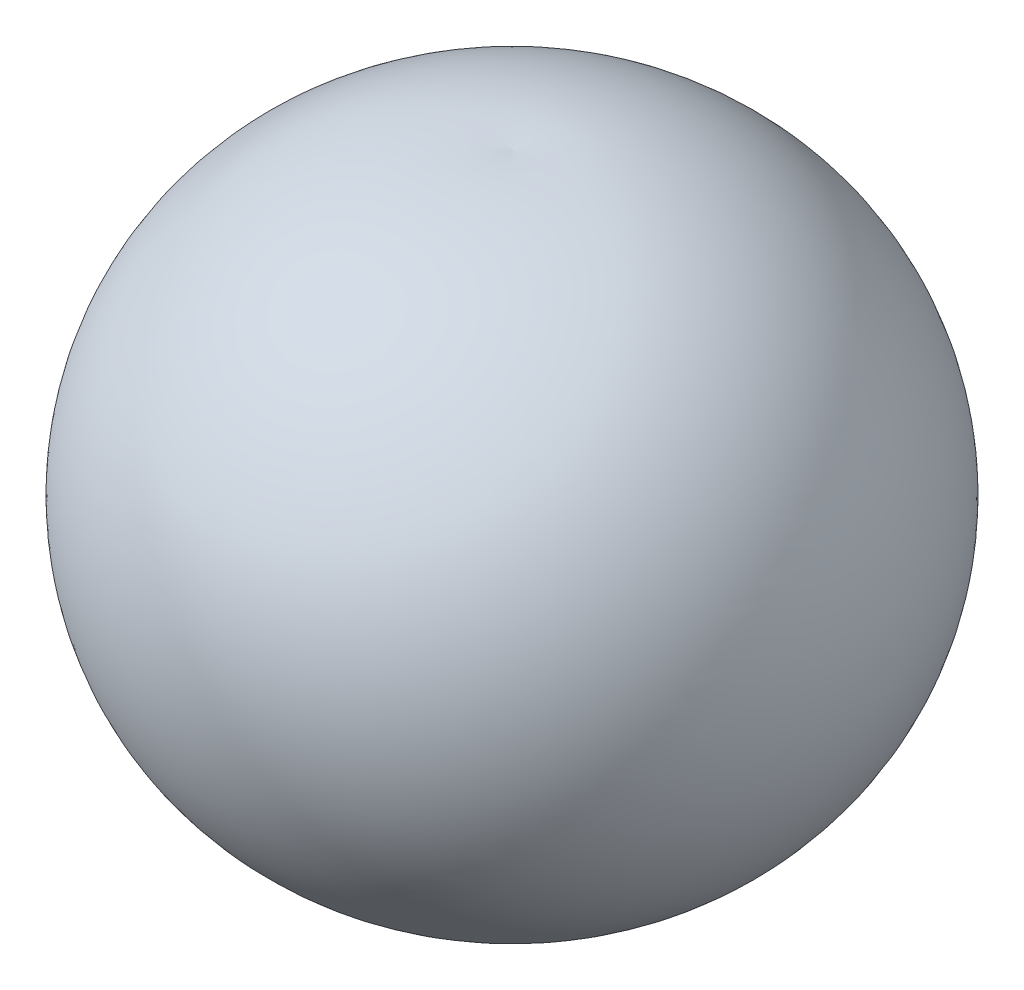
ISO-10303-21;
HEADER;
FILE_DESCRIPTION(('STEP AP214'),'2;1');
FILE_NAME('part.step','',(''),(''),'','','');
FILE_SCHEMA(('AUTOMOTIVE_DESIGN { 1 0 10303 214 1 1 1 1 }'));
ENDSEC;
DATA;
#1=APPLICATION_CONTEXT('core data for automotive mechanical design processes');
#2=APPLICATION_PROTOCOL_DEFINITION('international standard','automotive_design',2000,#1);
#3=PRODUCT_CONTEXT('',#1,'mechanical');
#4=PRODUCT('Part','Part','',(#3));
#5=PRODUCT_RELATED_PRODUCT_CATEGORY('part','',(#4));
#6=PRODUCT_DEFINITION_FORMATION('','',#4);
#7=PRODUCT_DEFINITION_CONTEXT('part definition',#1,'design');
#8=PRODUCT_DEFINITION('design','',#6,#7);
#9=PRODUCT_DEFINITION_SHAPE('','',#8);
#10=(LENGTH_UNIT() NAMED_UNIT(*) SI_UNIT(.MILLI.,.METRE.));
#11=(NAMED_UNIT(*) PLANE_ANGLE_UNIT() SI_UNIT($,.RADIAN.));
#12=(NAMED_UNIT(*) SI_UNIT($,.STERADIAN.) SOLID_ANGLE_UNIT());
#13=UNCERTAINTY_MEASURE_WITH_UNIT(LENGTH_MEASURE(1.E-05),#10,'distance_accuracy_value','');
#14=(GEOMETRIC_REPRESENTATION_CONTEXT(3) GLOBAL_UNCERTAINTY_ASSIGNED_CONTEXT((#13)) GLOBAL_UNIT_ASSIGNED_CONTEXT((#10,
#11,#12)) REPRESENTATION_CONTEXT('',''));
#15=CARTESIAN_POINT('',(0.,0.,0.));
#16=DIRECTION('',(0.,0.,1.));
#17=DIRECTION('',(1.,0.,0.));
#18=AXIS2_PLACEMENT_3D('',#15,#16,#17);
#19=CARTESIAN_POINT('',(0.,0.,0.758307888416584));
#20=DIRECTION('',(-1.,0.,0.));
#21=DIRECTION('',(0.,0.,1.));
#22=AXIS2_PLACEMENT_3D('',#19,#20,#21);
#23=CIRCLE('',#22,7.9248);
#24=TRIMMED_CURVE('',#23,(PARAMETER_VALUE(-1.6666309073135)),(PARAMETER_VALUE(1.6666309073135)),
.T.,.PARAMETER.);
#25=CARTESIAN_POINT('',(0.,0.,0.));
#26=DIRECTION('',(0.,1.,0.));
#27=AXIS1_PLACEMENT('',#25,#26);
#28=SURFACE_OF_REVOLUTION('',#24,#27);
#29=CARTESIAN_POINT('',(0.,7.88843610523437,0.));
#30=VERTEX_POINT('',#29);
#31=VERTEX_LOOP('',#30);
#32=FACE_BOUND('',#31,.T.);
#33=CARTESIAN_POINT('',(0.,-7.88843610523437,0.));
#34=VERTEX_POINT('',#33);
#35=VERTEX_LOOP('',#34);
#36=FACE_BOUND('',#35,.T.);
#37=ADVANCED_FACE('F32',(#32,#36),#28,.T.);
#38=CLOSED_SHELL('',(#37));
#39=MANIFOLD_SOLID_BREP('B2',#38);
#40=ADVANCED_BREP_SHAPE_REPRESENTATION('',(#18,#39),#14);
#41=SHAPE_DEFINITION_REPRESENTATION(#9,#40);
ENDSEC;
END-ISO-10303-21;
